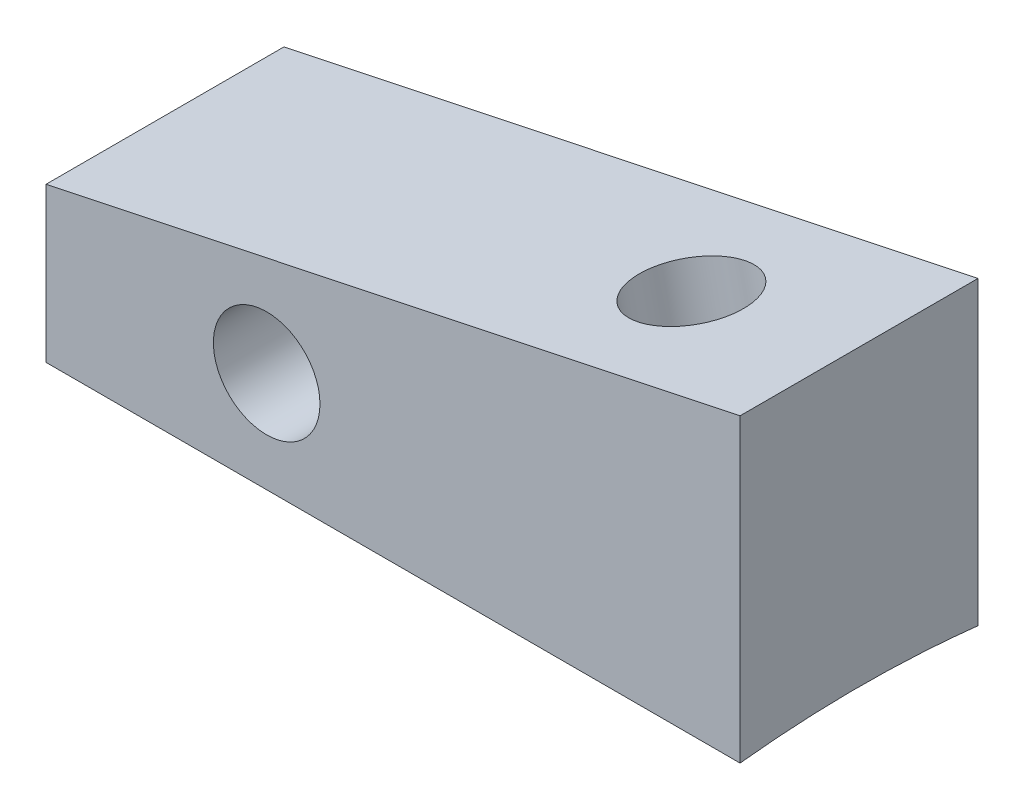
from build123d import *

# Parameters (mm, degrees)
EXTRUDE1_DEPTH        = 6.35
F_4_40_TAPPED_HOLE2_D = 2.8448
F_4_40_TAPPED_HOLE1_D = 2.8448
CUT_EXTRUDE1_DEPTH    = 22.162074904


with BuildPart() as part:
    # Sketch1 → Extrude1 (new body)
    with BuildSketch(Plane.XY):
        Polygon((-18.522629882, 4.116797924), (-18.522629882, 0), (0, 0), (-0.00068148, 8.026399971), align=None)
    extrude(amount=EXTRUDE1_DEPTH)

    # 4-40 Tapped Hole2 (through all)
    with Locations(Plane(origin=(-4.474111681, 7.082150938, 3.175), x_dir=(0.978440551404, 0.20652865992, 0), z_dir=(-0.20652865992, 0.978440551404, 0))):
        with Locations((0, 0)):
            Hole(F_4_40_TAPPED_HOLE2_D / 2)

    # 4-40 Tapped Hole1 (through all)
    with Locations(Plane(origin=(-12.633412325, 2.6924, 6.35), x_dir=(1, 0, 0), z_dir=(0, 0, 1))):
        with Locations((0, 0)):
            Hole(F_4_40_TAPPED_HOLE1_D / 2)

    # Sketch5 → Cut-Extrude1 (cut, through all)
    with BuildSketch(Plane.ZY.offset(18.522629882)):
        with BuildLine():
            Line((0, 0), (0, -0.352497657))
            Line((0, -0.352497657), (6.35, -0.352497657))
            Line((6.35, -0.352497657), (6.35, 0))
            ThreePointArc((6.35, 0), (3.175, 0.176936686), (0, 0))
        make_face()
    extrude(amount=-CUT_EXTRUDE1_DEPTH, mode=Mode.SUBTRACT)


solid = part.part
